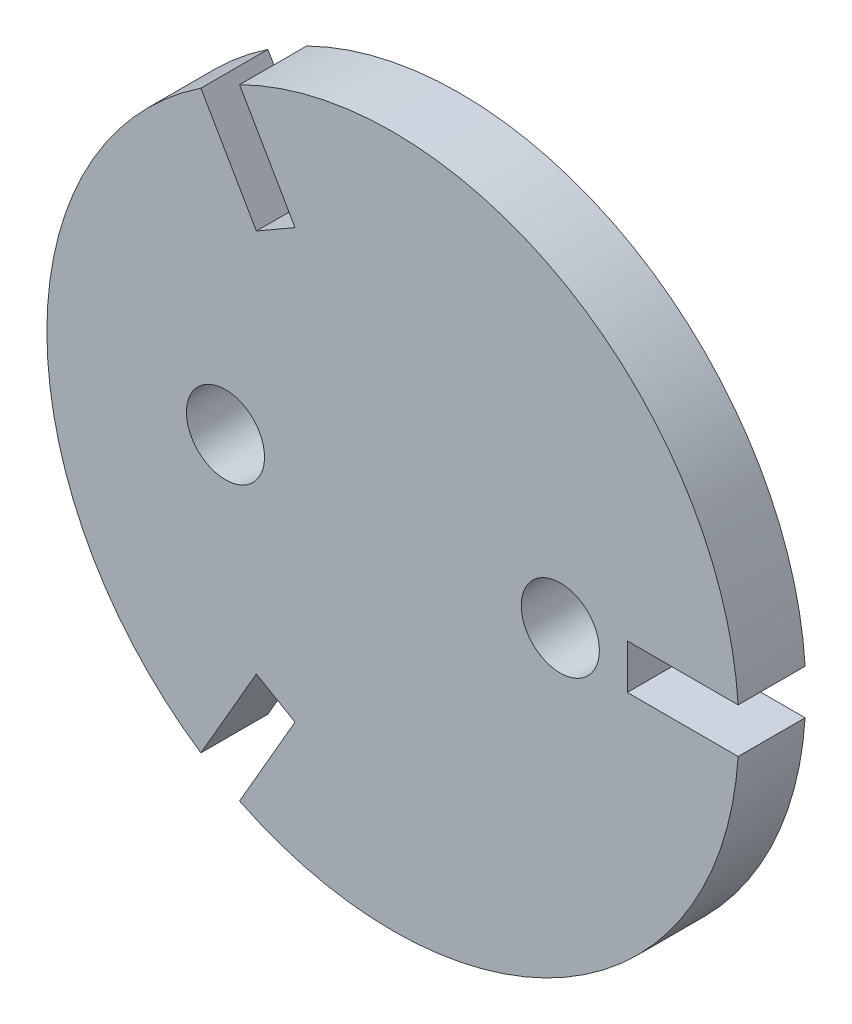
from build123d import *

# Parameters (mm, degrees)
ESQUISSE1_R             = 15.5
ESQUISSE1_R_2           = 1.75
BOSS_EXTRU_1_DEPTH      = 3
ESQUISSE2_W             = 5.713039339
ESQUISSE2_H             = 2
ENL_V_MAT_EXTRU_1_DEPTH = 3


with BuildPart() as part:
    # Esquisse1 → Boss.-Extru.1 (new body)
    with BuildSketch(Plane.XY):
        Circle(ESQUISSE1_R)
        with Locations((7.5, 0)):
            Circle(ESQUISSE1_R_2, mode=Mode.SUBTRACT)
        with Locations((-7.5, 0)):
            Circle(ESQUISSE1_R_2, mode=Mode.SUBTRACT)
    extrude(amount=BOSS_EXTRU_1_DEPTH)

    # Esquisse2 → Enl_v. mat.-Extru.1 (cut)
    with BuildSketch(Plane.XY.offset(3)):
        Polygon((-7.240494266, -14.54090394), (-4.383974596, -9.59326674), (-6.116025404, -8.59326674), (-8.972545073, -13.54090394), align=None)
        with Locations((13.35651967, 0)):
            Rectangle(ESQUISSE2_W, ESQUISSE2_H)
        Polygon((-8.972545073, 13.54090394), (-6.116025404, 8.59326674), (-4.383974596, 9.59326674), (-7.240494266, 14.54090394), align=None)
    extrude(amount=-ENL_V_MAT_EXTRU_1_DEPTH, mode=Mode.SUBTRACT)


solid = part.part
